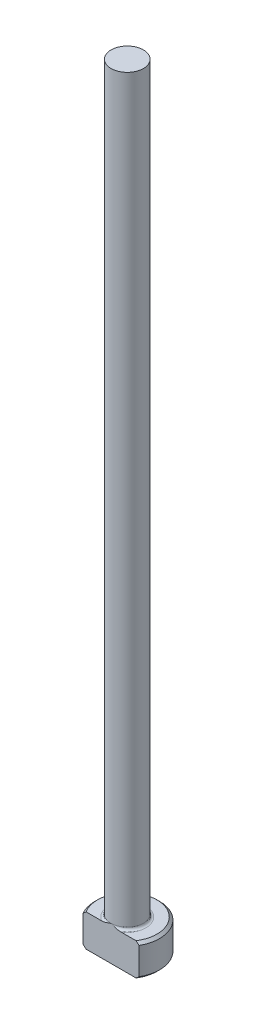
from build123d import *

# Parameters (mm, degrees)
CHAMFER1_SIZE = 0.254
FILLET1_R     = 0.254
KEY_DEPTH     = 77.332177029


with BuildPart() as part:
    # Sketch1 → Revolve1 (revolve)
    with BuildSketch(Plane.XY, mode=Mode.PRIVATE) as revolve1_sk:
        Polygon((0, 0), (-3.175, 0), (-3.175, 3.175), (-1.5875, 3.175), (-1.5875, 76.2), (0, 76.2), align=None)
    revolve(revolve1_sk.sketch.rotate(Axis((0, 259.958771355, 0), (0, -1, 0)), 270), axis=Axis((0, 259.958771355, 0), (0, -1, 0)))

    # Chamfer1
    chamfer1_edges = [part.edges().sort_by_distance(p)[0] for p in [
        (0, 3.175, -3.175),
        (0, 0, -3.175),
    ]]
    chamfer(chamfer1_edges, length=CHAMFER1_SIZE)

    # Fillet1
    fillet1_edges = [part.edges().sort_by_distance(p)[0] for p in [
        (0, 3.175, -1.5875),
    ]]
    fillet(fillet1_edges, radius=FILLET1_R)

    # Sketch2 → Key (cut, through all)
    with BuildSketch(Plane(origin=(0, 0, 0), x_dir=(1, 0, 0), z_dir=(0, 1, 0))):
        with BuildLine():
            Line((-2.749630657, -1.5875), (2.749630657, -1.5875))
            ThreePointArc((2.749630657, -1.5875), (0, -3.175), (-2.749630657, -1.5875))
        make_face()
    extrude(amount=KEY_DEPTH, mode=Mode.SUBTRACT)


solid = part.part
